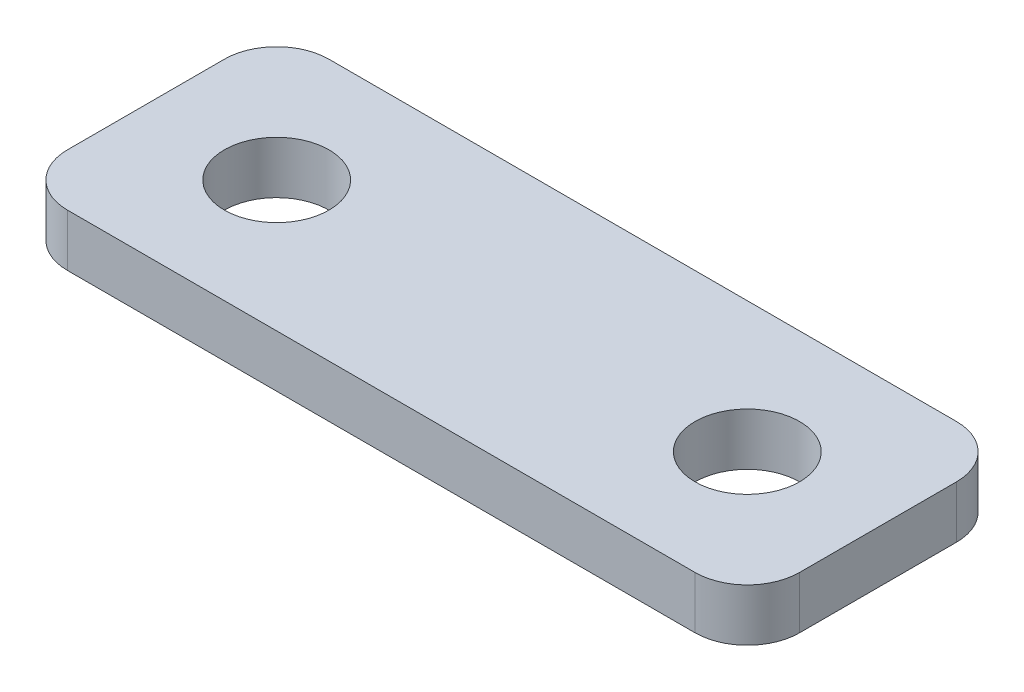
from build123d import *

# Parameters (mm, degrees)
SKETCH1_R           = 3.175
BOSS_EXTRUDE1_DEPTH = 3.175


with BuildPart() as part:
    # Sketch1 → Boss-Extrude1 (new body)
    with BuildSketch(Plane(origin=(0, 0, 0), x_dir=(1, 0, 0), z_dir=(0, 1, 0))):
        with BuildLine():
            Line((-19.05, 7.9375), (19.05, 7.9375))
            ThreePointArc((19.05, 7.9375), (21.29506403, 7.00756403), (22.225, 4.7625))
            Line((22.225, 4.7625), (22.225, -4.7625))
            ThreePointArc((22.225, -4.7625), (21.29506403, -7.00756403), (19.05, -7.9375))
            Line((19.05, -7.9375), (-19.05, -7.9375))
            ThreePointArc((-19.05, -7.9375), (-21.29506403, -7.00756403), (-22.225, -4.7625))
            Line((-22.225, -4.7625), (-22.225, 4.7625))
            ThreePointArc((-22.225, 4.7625), (-21.29506403, 7.00756403), (-19.05, 7.9375))
        make_face()
        with Locations(Location((-14.2875, 0, 0), (0, 0, 270))):
            Circle(SKETCH1_R, mode=Mode.SUBTRACT)
        with Locations(Location((14.2875, 0, 0), (0, 0, 270))):
            Circle(SKETCH1_R, mode=Mode.SUBTRACT)
    extrude(amount=BOSS_EXTRUDE1_DEPTH)


solid = part.part
